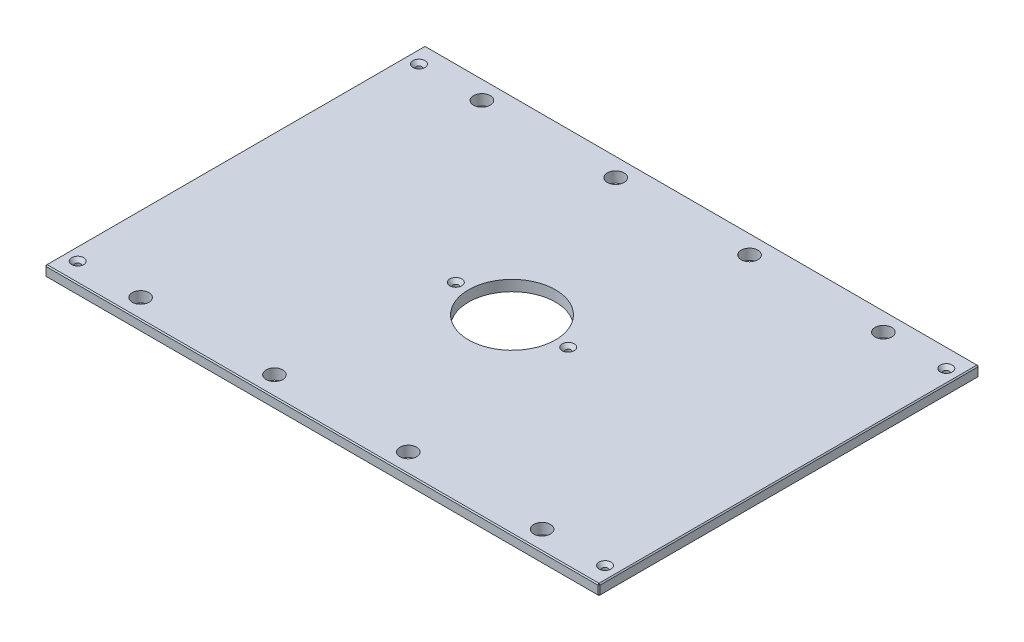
ISO-10303-21;
HEADER;
FILE_DESCRIPTION(('STEP AP214'),'2;1');
FILE_NAME('part.step','',(''),(''),'','','');
FILE_SCHEMA(('AUTOMOTIVE_DESIGN { 1 0 10303 214 1 1 1 1 }'));
ENDSEC;
DATA;
#1=APPLICATION_CONTEXT('core data for automotive mechanical design processes');
#2=APPLICATION_PROTOCOL_DEFINITION('international standard','automotive_design',2000,#1);
#3=PRODUCT_CONTEXT('',#1,'mechanical');
#4=PRODUCT('Part','Part','',(#3));
#5=PRODUCT_RELATED_PRODUCT_CATEGORY('part','',(#4));
#6=PRODUCT_DEFINITION_FORMATION('','',#4);
#7=PRODUCT_DEFINITION_CONTEXT('part definition',#1,'design');
#8=PRODUCT_DEFINITION('design','',#6,#7);
#9=PRODUCT_DEFINITION_SHAPE('','',#8);
#10=(LENGTH_UNIT() NAMED_UNIT(*) SI_UNIT(.MILLI.,.METRE.));
#11=(NAMED_UNIT(*) PLANE_ANGLE_UNIT() SI_UNIT($,.RADIAN.));
#12=(NAMED_UNIT(*) SI_UNIT($,.STERADIAN.) SOLID_ANGLE_UNIT());
#13=UNCERTAINTY_MEASURE_WITH_UNIT(LENGTH_MEASURE(1.E-05),#10,'distance_accuracy_value','');
#14=(GEOMETRIC_REPRESENTATION_CONTEXT(3) GLOBAL_UNCERTAINTY_ASSIGNED_CONTEXT((#13)) GLOBAL_UNIT_ASSIGNED_CONTEXT((#10,
#11,#12)) REPRESENTATION_CONTEXT('',''));
#15=CARTESIAN_POINT('',(0.,0.,0.));
#16=DIRECTION('',(0.,0.,1.));
#17=DIRECTION('',(1.,0.,0.));
#18=AXIS2_PLACEMENT_3D('',#15,#16,#17);
#19=CARTESIAN_POINT('',(-328.6125,12.7,-225.425));
#20=DIRECTION('',(1.,0.,0.));
#21=DIRECTION('',(0.,0.,-1.));
#22=AXIS2_PLACEMENT_3D('',#19,#20,#21);
#23=PLANE('',#22);
#24=DIRECTION('',(0.,0.,-1.));
#25=VECTOR('',#24,1.);
#26=CARTESIAN_POINT('',(-328.6125,11.43,-225.425));
#27=LINE('',#26,#25);
#28=CARTESIAN_POINT('',(-328.6125,11.43,224.155));
#29=VERTEX_POINT('',#28);
#30=CARTESIAN_POINT('',(-328.6125,11.43,-224.155));
#31=VERTEX_POINT('',#30);
#32=EDGE_CURVE('E135',#29,#31,#27,.T.);
#33=ORIENTED_EDGE('',*,*,#32,.T.);
#34=DIRECTION('',(0.,-1.,0.));
#35=VECTOR('',#34,1.);
#36=CARTESIAN_POINT('',(-328.6125,12.7,-224.155));
#37=LINE('',#36,#35);
#38=CARTESIAN_POINT('',(-328.6125,1.26999999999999,-224.155));
#39=VERTEX_POINT('',#38);
#40=EDGE_CURVE('E131',#31,#39,#37,.T.);
#41=ORIENTED_EDGE('',*,*,#40,.T.);
#42=DIRECTION('',(0.,0.,1.));
#43=VECTOR('',#42,1.);
#44=CARTESIAN_POINT('',(-328.6125,1.26999999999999,-225.425));
#45=LINE('',#44,#43);
#46=CARTESIAN_POINT('',(-328.6125,1.26999999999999,224.155));
#47=VERTEX_POINT('',#46);
#48=EDGE_CURVE('E126',#39,#47,#45,.T.);
#49=ORIENTED_EDGE('',*,*,#48,.T.);
#50=DIRECTION('',(0.,1.,0.));
#51=VECTOR('',#50,1.);
#52=CARTESIAN_POINT('',(-328.6125,12.7,224.155));
#53=LINE('',#52,#51);
#54=EDGE_CURVE('E128',#47,#29,#53,.T.);
#55=ORIENTED_EDGE('',*,*,#54,.T.);
#56=EDGE_LOOP('',(#33,#41,#49,#55));
#57=FACE_BOUND('',#56,.T.);
#58=ADVANCED_FACE('F35',(#57),#23,.F.);
#59=CARTESIAN_POINT('',(-328.6125,12.7,225.425));
#60=DIRECTION('',(0.,0.,-1.));
#61=DIRECTION('',(-1.,0.,0.));
#62=AXIS2_PLACEMENT_3D('',#59,#60,#61);
#63=PLANE('',#62);
#64=DIRECTION('',(1.,0.,0.));
#65=VECTOR('',#64,1.);
#66=CARTESIAN_POINT('',(-328.6125,1.2700000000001,225.425));
#67=LINE('',#66,#65);
#68=CARTESIAN_POINT('',(-327.3425,1.2700000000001,225.425));
#69=VERTEX_POINT('',#68);
#70=CARTESIAN_POINT('',(327.3425,1.2700000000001,225.425));
#71=VERTEX_POINT('',#70);
#72=EDGE_CURVE('E58',#69,#71,#67,.T.);
#73=ORIENTED_EDGE('',*,*,#72,.T.);
#74=DIRECTION('',(0.,1.,0.));
#75=VECTOR('',#74,1.);
#76=CARTESIAN_POINT('',(327.3425,12.7,225.425));
#77=LINE('',#76,#75);
#78=CARTESIAN_POINT('',(327.3425,11.4299999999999,225.425));
#79=VERTEX_POINT('',#78);
#80=EDGE_CURVE('E11',#71,#79,#77,.T.);
#81=ORIENTED_EDGE('',*,*,#80,.T.);
#82=DIRECTION('',(-1.,0.,0.));
#83=VECTOR('',#82,1.);
#84=CARTESIAN_POINT('',(-328.6125,11.4299999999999,225.425));
#85=LINE('',#84,#83);
#86=CARTESIAN_POINT('',(-327.3425,11.4299999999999,225.425));
#87=VERTEX_POINT('',#86);
#88=EDGE_CURVE('E44',#79,#87,#85,.T.);
#89=ORIENTED_EDGE('',*,*,#88,.T.);
#90=DIRECTION('',(0.,-1.,0.));
#91=VECTOR('',#90,1.);
#92=CARTESIAN_POINT('',(-327.3425,12.7,225.425));
#93=LINE('',#92,#91);
#94=EDGE_CURVE('E303',#87,#69,#93,.T.);
#95=ORIENTED_EDGE('',*,*,#94,.T.);
#96=EDGE_LOOP('',(#73,#81,#89,#95));
#97=FACE_BOUND('',#96,.T.);
#98=ADVANCED_FACE('F372',(#97),#63,.F.);
#99=CARTESIAN_POINT('',(328.6125,12.7,-225.425));
#100=DIRECTION('',(-1.,0.,0.));
#101=DIRECTION('',(0.,0.,1.));
#102=AXIS2_PLACEMENT_3D('',#99,#100,#101);
#103=PLANE('',#102);
#104=DIRECTION('',(0.,0.,-1.));
#105=VECTOR('',#104,1.);
#106=CARTESIAN_POINT('',(328.6125,1.2700000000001,-225.425));
#107=LINE('',#106,#105);
#108=CARTESIAN_POINT('',(328.6125,1.2700000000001,224.155));
#109=VERTEX_POINT('',#108);
#110=CARTESIAN_POINT('',(328.6125,1.2700000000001,-224.155));
#111=VERTEX_POINT('',#110);
#112=EDGE_CURVE('E298',#109,#111,#107,.T.);
#113=ORIENTED_EDGE('',*,*,#112,.T.);
#114=DIRECTION('',(0.,1.,0.));
#115=VECTOR('',#114,1.);
#116=CARTESIAN_POINT('',(328.6125,12.7,-224.155));
#117=LINE('',#116,#115);
#118=CARTESIAN_POINT('',(328.6125,11.43,-224.155));
#119=VERTEX_POINT('',#118);
#120=EDGE_CURVE('E300',#111,#119,#117,.T.);
#121=ORIENTED_EDGE('',*,*,#120,.T.);
#122=DIRECTION('',(0.,0.,1.));
#123=VECTOR('',#122,1.);
#124=CARTESIAN_POINT('',(328.6125,11.43,225.425));
#125=LINE('',#124,#123);
#126=CARTESIAN_POINT('',(328.6125,11.43,224.155));
#127=VERTEX_POINT('',#126);
#128=EDGE_CURVE('E296',#119,#127,#125,.T.);
#129=ORIENTED_EDGE('',*,*,#128,.T.);
#130=DIRECTION('',(0.,-1.,0.));
#131=VECTOR('',#130,1.);
#132=CARTESIAN_POINT('',(328.6125,12.7,224.155));
#133=LINE('',#132,#131);
#134=EDGE_CURVE('E294',#127,#109,#133,.T.);
#135=ORIENTED_EDGE('',*,*,#134,.T.);
#136=EDGE_LOOP('',(#113,#121,#129,#135));
#137=FACE_BOUND('',#136,.T.);
#138=ADVANCED_FACE('F359',(#137),#103,.F.);
#139=CARTESIAN_POINT('',(-328.6125,12.7,-225.425));
#140=DIRECTION('',(0.,0.,1.));
#141=DIRECTION('',(1.,0.,0.));
#142=AXIS2_PLACEMENT_3D('',#139,#140,#141);
#143=PLANE('',#142);
#144=DIRECTION('',(-1.,0.,0.));
#145=VECTOR('',#144,1.);
#146=CARTESIAN_POINT('',(-328.6125,1.2700000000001,-225.425));
#147=LINE('',#146,#145);
#148=CARTESIAN_POINT('',(327.3425,1.2700000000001,-225.425));
#149=VERTEX_POINT('',#148);
#150=CARTESIAN_POINT('',(-327.3425,1.2700000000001,-225.425));
#151=VERTEX_POINT('',#150);
#152=EDGE_CURVE('E270',#149,#151,#147,.T.);
#153=ORIENTED_EDGE('',*,*,#152,.T.);
#154=DIRECTION('',(0.,1.,0.));
#155=VECTOR('',#154,1.);
#156=CARTESIAN_POINT('',(-327.3425,12.7,-225.425));
#157=LINE('',#156,#155);
#158=CARTESIAN_POINT('',(-327.3425,11.43,-225.425));
#159=VERTEX_POINT('',#158);
#160=EDGE_CURVE('E274',#151,#159,#157,.T.);
#161=ORIENTED_EDGE('',*,*,#160,.T.);
#162=DIRECTION('',(1.,0.,0.));
#163=VECTOR('',#162,1.);
#164=CARTESIAN_POINT('',(328.6125,11.43,-225.425));
#165=LINE('',#164,#163);
#166=CARTESIAN_POINT('',(327.3425,11.43,-225.425));
#167=VERTEX_POINT('',#166);
#168=EDGE_CURVE('E272',#159,#167,#165,.T.);
#169=ORIENTED_EDGE('',*,*,#168,.T.);
#170=DIRECTION('',(0.,-1.,0.));
#171=VECTOR('',#170,1.);
#172=CARTESIAN_POINT('',(327.3425,12.7,-225.425));
#173=LINE('',#172,#171);
#174=EDGE_CURVE('E268',#167,#149,#173,.T.);
#175=ORIENTED_EDGE('',*,*,#174,.T.);
#176=EDGE_LOOP('',(#153,#161,#169,#175));
#177=FACE_BOUND('',#176,.T.);
#178=ADVANCED_FACE('F333',(#177),#143,.F.);
#179=CARTESIAN_POINT('',(0.,12.7,0.));
#180=DIRECTION('',(0.,1.,0.));
#181=DIRECTION('',(0.,0.,1.));
#182=AXIS2_PLACEMENT_3D('',#179,#180,#181);
#183=PLANE('',#182);
#184=CARTESIAN_POINT('',(312.7375,12.7,-202.40498));
#185=DIRECTION('',(0.,1.,0.));
#186=DIRECTION('',(0.,0.,1.));
#187=AXIS2_PLACEMENT_3D('',#184,#185,#186);
#188=CIRCLE('',#187,7.13740000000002);
#189=CARTESIAN_POINT('',(312.7375,12.7,-195.26758));
#190=VERTEX_POINT('',#189);
#191=EDGE_CURVE('E816',#190,#190,#188,.T.);
#192=ORIENTED_EDGE('',*,*,#191,.F.);
#193=EDGE_LOOP('',(#192));
#194=FACE_BOUND('',#193,.T.);
#195=CARTESIAN_POINT('',(312.7375,12.7,202.40498));
#196=DIRECTION('',(0.,1.,0.));
#197=DIRECTION('',(0.,0.,1.));
#198=AXIS2_PLACEMENT_3D('',#195,#196,#197);
#199=CIRCLE('',#198,7.13740000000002);
#200=CARTESIAN_POINT('',(312.7375,12.7,209.54238));
#201=VERTEX_POINT('',#200);
#202=EDGE_CURVE('E820',#201,#201,#199,.T.);
#203=ORIENTED_EDGE('',*,*,#202,.F.);
#204=EDGE_LOOP('',(#203));
#205=FACE_BOUND('',#204,.T.);
#206=CARTESIAN_POINT('',(-312.7375,12.7,202.40498));
#207=DIRECTION('',(0.,1.,0.));
#208=DIRECTION('',(0.,0.,1.));
#209=AXIS2_PLACEMENT_3D('',#206,#207,#208);
#210=CIRCLE('',#209,7.13740000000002);
#211=CARTESIAN_POINT('',(-312.7375,12.7,209.54238));
#212=VERTEX_POINT('',#211);
#213=EDGE_CURVE('E824',#212,#212,#210,.T.);
#214=ORIENTED_EDGE('',*,*,#213,.F.);
#215=EDGE_LOOP('',(#214));
#216=FACE_BOUND('',#215,.T.);
#217=CARTESIAN_POINT('',(-66.675,12.7,0.));
#218=DIRECTION('',(0.,1.,0.));
#219=DIRECTION('',(0.,0.,1.));
#220=AXIS2_PLACEMENT_3D('',#217,#218,#219);
#221=CIRCLE('',#220,7.1374);
#222=CARTESIAN_POINT('',(-66.675,12.7,7.1374));
#223=VERTEX_POINT('',#222);
#224=EDGE_CURVE('E828',#223,#223,#221,.T.);
#225=ORIENTED_EDGE('',*,*,#224,.F.);
#226=EDGE_LOOP('',(#225));
#227=FACE_BOUND('',#226,.T.);
#228=CARTESIAN_POINT('',(66.675,12.7,0.));
#229=DIRECTION('',(0.,1.,0.));
#230=DIRECTION('',(0.,0.,1.));
#231=AXIS2_PLACEMENT_3D('',#228,#229,#230);
#232=CIRCLE('',#231,7.1374);
#233=CARTESIAN_POINT('',(66.675,12.7,7.1374));
#234=VERTEX_POINT('',#233);
#235=EDGE_CURVE('E832',#234,#234,#232,.T.);
#236=ORIENTED_EDGE('',*,*,#235,.F.);
#237=EDGE_LOOP('',(#236));
#238=FACE_BOUND('',#237,.T.);
#239=CARTESIAN_POINT('',(-312.7375,12.7,-202.40498));
#240=DIRECTION('',(0.,1.,0.));
#241=DIRECTION('',(0.,0.,1.));
#242=AXIS2_PLACEMENT_3D('',#239,#240,#241);
#243=CIRCLE('',#242,7.13740000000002);
#244=CARTESIAN_POINT('',(-312.7375,12.7,-195.26758));
#245=VERTEX_POINT('',#244);
#246=EDGE_CURVE('E835',#245,#245,#243,.T.);
#247=ORIENTED_EDGE('',*,*,#246,.F.);
#248=EDGE_LOOP('',(#247));
#249=FACE_BOUND('',#248,.T.);
#250=DIRECTION('',(0.,0.,-1.));
#251=VECTOR('',#250,1.);
#252=CARTESIAN_POINT('',(327.3425,12.7,-225.425));
#253=LINE('',#252,#251);
#254=CARTESIAN_POINT('',(327.3425,12.7,224.155));
#255=VERTEX_POINT('',#254);
#256=CARTESIAN_POINT('',(327.3425,12.7,-224.155));
#257=VERTEX_POINT('',#256);
#258=EDGE_CURVE('E281',#255,#257,#253,.T.);
#259=ORIENTED_EDGE('',*,*,#258,.T.);
#260=DIRECTION('',(-1.,0.,0.));
#261=VECTOR('',#260,1.);
#262=CARTESIAN_POINT('',(-328.6125,12.7,-224.155));
#263=LINE('',#262,#261);
#264=CARTESIAN_POINT('',(-327.3425,12.7,-224.155));
#265=VERTEX_POINT('',#264);
#266=EDGE_CURVE('E283',#257,#265,#263,.T.);
#267=ORIENTED_EDGE('',*,*,#266,.T.);
#268=DIRECTION('',(0.,0.,1.));
#269=VECTOR('',#268,1.);
#270=CARTESIAN_POINT('',(-327.3425,12.7,225.425));
#271=LINE('',#270,#269);
#272=CARTESIAN_POINT('',(-327.3425,12.7,224.155));
#273=VERTEX_POINT('',#272);
#274=EDGE_CURVE('E279',#265,#273,#271,.T.);
#275=ORIENTED_EDGE('',*,*,#274,.T.);
#276=DIRECTION('',(1.,0.,0.));
#277=VECTOR('',#276,1.);
#278=CARTESIAN_POINT('',(328.6125,12.7,224.155));
#279=LINE('',#278,#277);
#280=EDGE_CURVE('E277',#273,#255,#279,.T.);
#281=ORIENTED_EDGE('',*,*,#280,.T.);
#282=EDGE_LOOP('',(#259,#267,#275,#281));
#283=FACE_BOUND('',#282,.T.);
#284=CARTESIAN_POINT('',(238.125,12.7,-202.40498));
#285=DIRECTION('',(0.,1.,0.));
#286=DIRECTION('',(0.,0.,1.));
#287=AXIS2_PLACEMENT_3D('',#284,#285,#286);
#288=CIRCLE('',#287,9.921875);
#289=CARTESIAN_POINT('',(238.125,12.7,-192.483105));
#290=VERTEX_POINT('',#289);
#291=EDGE_CURVE('E204',#290,#290,#288,.T.);
#292=ORIENTED_EDGE('',*,*,#291,.F.);
#293=EDGE_LOOP('',(#292));
#294=FACE_BOUND('',#293,.T.);
#295=CARTESIAN_POINT('',(-238.125,12.7,-202.40498));
#296=DIRECTION('',(0.,1.,0.));
#297=DIRECTION('',(0.,0.,1.));
#298=AXIS2_PLACEMENT_3D('',#295,#296,#297);
#299=CIRCLE('',#298,9.921875);
#300=CARTESIAN_POINT('',(-238.125,12.7,-192.483105));
#301=VERTEX_POINT('',#300);
#302=EDGE_CURVE('E214',#301,#301,#299,.T.);
#303=ORIENTED_EDGE('',*,*,#302,.F.);
#304=EDGE_LOOP('',(#303));
#305=FACE_BOUND('',#304,.T.);
#306=CARTESIAN_POINT('',(238.125,12.7,202.40498));
#307=DIRECTION('',(0.,1.,0.));
#308=DIRECTION('',(0.,0.,1.));
#309=AXIS2_PLACEMENT_3D('',#306,#307,#308);
#310=CIRCLE('',#309,9.921875);
#311=CARTESIAN_POINT('',(238.125,12.7,212.326855));
#312=VERTEX_POINT('',#311);
#313=EDGE_CURVE('E225',#312,#312,#310,.T.);
#314=ORIENTED_EDGE('',*,*,#313,.F.);
#315=EDGE_LOOP('',(#314));
#316=FACE_BOUND('',#315,.T.);
#317=CARTESIAN_POINT('',(-238.125,12.7,202.40498));
#318=DIRECTION('',(0.,1.,0.));
#319=DIRECTION('',(0.,0.,1.));
#320=AXIS2_PLACEMENT_3D('',#317,#318,#319);
#321=CIRCLE('',#320,9.921875);
#322=CARTESIAN_POINT('',(-238.125,12.7,212.326855));
#323=VERTEX_POINT('',#322);
#324=EDGE_CURVE('E231',#323,#323,#321,.T.);
#325=ORIENTED_EDGE('',*,*,#324,.F.);
#326=EDGE_LOOP('',(#325));
#327=FACE_BOUND('',#326,.T.);
#328=CARTESIAN_POINT('',(-79.375,12.7,-202.40498));
#329=DIRECTION('',(0.,1.,0.));
#330=DIRECTION('',(0.,0.,1.));
#331=AXIS2_PLACEMENT_3D('',#328,#329,#330);
#332=CIRCLE('',#331,9.921875);
#333=CARTESIAN_POINT('',(-79.375,12.7,-192.483105));
#334=VERTEX_POINT('',#333);
#335=EDGE_CURVE('E237',#334,#334,#332,.T.);
#336=ORIENTED_EDGE('',*,*,#335,.F.);
#337=EDGE_LOOP('',(#336));
#338=FACE_BOUND('',#337,.T.);
#339=CARTESIAN_POINT('',(79.375,12.7,-202.40498));
#340=DIRECTION('',(0.,1.,0.));
#341=DIRECTION('',(0.,0.,1.));
#342=AXIS2_PLACEMENT_3D('',#339,#340,#341);
#343=CIRCLE('',#342,9.921875);
#344=CARTESIAN_POINT('',(79.375,12.7,-192.483105));
#345=VERTEX_POINT('',#344);
#346=EDGE_CURVE('E243',#345,#345,#343,.T.);
#347=ORIENTED_EDGE('',*,*,#346,.F.);
#348=EDGE_LOOP('',(#347));
#349=FACE_BOUND('',#348,.T.);
#350=CARTESIAN_POINT('',(79.375,12.7,202.40498));
#351=DIRECTION('',(0.,1.,0.));
#352=DIRECTION('',(0.,0.,1.));
#353=AXIS2_PLACEMENT_3D('',#350,#351,#352);
#354=CIRCLE('',#353,9.921875);
#355=CARTESIAN_POINT('',(79.375,12.7,212.326855));
#356=VERTEX_POINT('',#355);
#357=EDGE_CURVE('E249',#356,#356,#354,.T.);
#358=ORIENTED_EDGE('',*,*,#357,.F.);
#359=EDGE_LOOP('',(#358));
#360=FACE_BOUND('',#359,.T.);
#361=CARTESIAN_POINT('',(-79.375,12.7,202.40498));
#362=DIRECTION('',(0.,1.,0.));
#363=DIRECTION('',(0.,0.,1.));
#364=AXIS2_PLACEMENT_3D('',#361,#362,#363);
#365=CIRCLE('',#364,9.921875);
#366=CARTESIAN_POINT('',(-79.375,12.7,212.326855));
#367=VERTEX_POINT('',#366);
#368=EDGE_CURVE('E255',#367,#367,#365,.T.);
#369=ORIENTED_EDGE('',*,*,#368,.F.);
#370=EDGE_LOOP('',(#369));
#371=FACE_BOUND('',#370,.T.);
#372=CARTESIAN_POINT('',(0.,12.7,0.));
#373=DIRECTION('',(0.,1.,0.));
#374=DIRECTION('',(0.,0.,1.));
#375=AXIS2_PLACEMENT_3D('',#372,#373,#374);
#376=CIRCLE('',#375,51.562);
#377=CARTESIAN_POINT('',(0.,12.7,51.562));
#378=VERTEX_POINT('',#377);
#379=EDGE_CURVE('E261',#378,#378,#376,.T.);
#380=ORIENTED_EDGE('',*,*,#379,.F.);
#381=EDGE_LOOP('',(#380));
#382=FACE_BOUND('',#381,.T.);
#383=ADVANCED_FACE('F381',(#194,#205,#216,#227,#238,#249,#283,#294,#305,#316,#327,#338,#349,
#360,#371,#382),#183,.T.);
#384=CARTESIAN_POINT('',(0.,0.,0.));
#385=DIRECTION('',(0.,1.,0.));
#386=DIRECTION('',(0.,0.,1.));
#387=AXIS2_PLACEMENT_3D('',#384,#385,#386);
#388=PLANE('',#387);
#389=CARTESIAN_POINT('',(312.7375,0.,-202.40498));
#390=DIRECTION('',(0.,1.,0.));
#391=DIRECTION('',(0.,0.,1.));
#392=AXIS2_PLACEMENT_3D('',#389,#390,#391);
#393=CIRCLE('',#392,3.3782);
#394=CARTESIAN_POINT('',(312.7375,0.,-199.02678));
#395=VERTEX_POINT('',#394);
#396=EDGE_CURVE('E869',#395,#395,#393,.T.);
#397=ORIENTED_EDGE('',*,*,#396,.T.);
#398=EDGE_LOOP('',(#397));
#399=FACE_BOUND('',#398,.T.);
#400=CARTESIAN_POINT('',(312.7375,0.,202.40498));
#401=DIRECTION('',(0.,1.,0.));
#402=DIRECTION('',(0.,0.,1.));
#403=AXIS2_PLACEMENT_3D('',#400,#401,#402);
#404=CIRCLE('',#403,3.3782);
#405=CARTESIAN_POINT('',(312.7375,0.,205.78318));
#406=VERTEX_POINT('',#405);
#407=EDGE_CURVE('E862',#406,#406,#404,.T.);
#408=ORIENTED_EDGE('',*,*,#407,.T.);
#409=EDGE_LOOP('',(#408));
#410=FACE_BOUND('',#409,.T.);
#411=CARTESIAN_POINT('',(-312.7375,0.,202.40498));
#412=DIRECTION('',(0.,1.,0.));
#413=DIRECTION('',(0.,0.,1.));
#414=AXIS2_PLACEMENT_3D('',#411,#412,#413);
#415=CIRCLE('',#414,3.3782);
#416=CARTESIAN_POINT('',(-312.7375,0.,205.78318));
#417=VERTEX_POINT('',#416);
#418=EDGE_CURVE('E855',#417,#417,#415,.T.);
#419=ORIENTED_EDGE('',*,*,#418,.T.);
#420=EDGE_LOOP('',(#419));
#421=FACE_BOUND('',#420,.T.);
#422=CARTESIAN_POINT('',(-66.675,0.,0.));
#423=DIRECTION('',(0.,1.,0.));
#424=DIRECTION('',(0.,0.,1.));
#425=AXIS2_PLACEMENT_3D('',#422,#423,#424);
#426=CIRCLE('',#425,3.3782);
#427=CARTESIAN_POINT('',(-66.675,0.,3.3782));
#428=VERTEX_POINT('',#427);
#429=EDGE_CURVE('E848',#428,#428,#426,.T.);
#430=ORIENTED_EDGE('',*,*,#429,.T.);
#431=EDGE_LOOP('',(#430));
#432=FACE_BOUND('',#431,.T.);
#433=CARTESIAN_POINT('',(66.675,0.,0.));
#434=DIRECTION('',(0.,1.,0.));
#435=DIRECTION('',(0.,0.,1.));
#436=AXIS2_PLACEMENT_3D('',#433,#434,#435);
#437=CIRCLE('',#436,3.3782);
#438=CARTESIAN_POINT('',(66.675,0.,3.3782));
#439=VERTEX_POINT('',#438);
#440=EDGE_CURVE('E838',#439,#439,#437,.T.);
#441=ORIENTED_EDGE('',*,*,#440,.T.);
#442=EDGE_LOOP('',(#441));
#443=FACE_BOUND('',#442,.T.);
#444=CARTESIAN_POINT('',(-312.7375,0.,-202.40498));
#445=DIRECTION('',(0.,1.,0.));
#446=DIRECTION('',(0.,0.,1.));
#447=AXIS2_PLACEMENT_3D('',#444,#445,#446);
#448=CIRCLE('',#447,3.3782);
#449=CARTESIAN_POINT('',(-312.7375,0.,-199.02678));
#450=VERTEX_POINT('',#449);
#451=EDGE_CURVE('E217',#450,#450,#448,.T.);
#452=ORIENTED_EDGE('',*,*,#451,.T.);
#453=EDGE_LOOP('',(#452));
#454=FACE_BOUND('',#453,.T.);
#455=DIRECTION('',(0.,0.,-1.));
#456=VECTOR('',#455,1.);
#457=CARTESIAN_POINT('',(-327.3425,0.,0.));
#458=LINE('',#457,#456);
#459=CARTESIAN_POINT('',(-327.3425,0.,224.155));
#460=VERTEX_POINT('',#459);
#461=CARTESIAN_POINT('',(-327.3425,0.,-224.155));
#462=VERTEX_POINT('',#461);
#463=EDGE_CURVE('E158',#460,#462,#458,.T.);
#464=ORIENTED_EDGE('',*,*,#463,.T.);
#465=DIRECTION('',(1.,0.,0.));
#466=VECTOR('',#465,1.);
#467=CARTESIAN_POINT('',(0.,0.,-224.155));
#468=LINE('',#467,#466);
#469=CARTESIAN_POINT('',(327.3425,0.,-224.155));
#470=VERTEX_POINT('',#469);
#471=EDGE_CURVE('E291',#462,#470,#468,.T.);
#472=ORIENTED_EDGE('',*,*,#471,.T.);
#473=DIRECTION('',(0.,0.,1.));
#474=VECTOR('',#473,1.);
#475=CARTESIAN_POINT('',(327.3425,0.,0.));
#476=LINE('',#475,#474);
#477=CARTESIAN_POINT('',(327.3425,0.,224.155));
#478=VERTEX_POINT('',#477);
#479=EDGE_CURVE('E289',#470,#478,#476,.T.);
#480=ORIENTED_EDGE('',*,*,#479,.T.);
#481=DIRECTION('',(-1.,0.,0.));
#482=VECTOR('',#481,1.);
#483=CARTESIAN_POINT('',(0.,0.,224.155));
#484=LINE('',#483,#482);
#485=EDGE_CURVE('E286',#478,#460,#484,.T.);
#486=ORIENTED_EDGE('',*,*,#485,.T.);
#487=EDGE_LOOP('',(#464,#472,#480,#486));
#488=FACE_BOUND('',#487,.T.);
#489=CARTESIAN_POINT('',(238.125,0.,-202.40498));
#490=DIRECTION('',(0.,1.,0.));
#491=DIRECTION('',(0.,0.,1.));
#492=AXIS2_PLACEMENT_3D('',#489,#490,#491);
#493=CIRCLE('',#492,9.921875);
#494=CARTESIAN_POINT('',(238.125,0.,-192.483105));
#495=VERTEX_POINT('',#494);
#496=EDGE_CURVE('E209',#495,#495,#493,.T.);
#497=ORIENTED_EDGE('',*,*,#496,.T.);
#498=EDGE_LOOP('',(#497));
#499=FACE_BOUND('',#498,.T.);
#500=CARTESIAN_POINT('',(-238.125,0.,-202.40498));
#501=DIRECTION('',(0.,1.,0.));
#502=DIRECTION('',(0.,0.,1.));
#503=AXIS2_PLACEMENT_3D('',#500,#501,#502);
#504=CIRCLE('',#503,9.921875);
#505=CARTESIAN_POINT('',(-238.125,0.,-192.483105));
#506=VERTEX_POINT('',#505);
#507=EDGE_CURVE('E222',#506,#506,#504,.T.);
#508=ORIENTED_EDGE('',*,*,#507,.T.);
#509=EDGE_LOOP('',(#508));
#510=FACE_BOUND('',#509,.T.);
#511=CARTESIAN_POINT('',(238.125,0.,202.40498));
#512=DIRECTION('',(0.,1.,0.));
#513=DIRECTION('',(0.,0.,1.));
#514=AXIS2_PLACEMENT_3D('',#511,#512,#513);
#515=CIRCLE('',#514,9.921875);
#516=CARTESIAN_POINT('',(238.125,0.,212.326855));
#517=VERTEX_POINT('',#516);
#518=EDGE_CURVE('E228',#517,#517,#515,.T.);
#519=ORIENTED_EDGE('',*,*,#518,.T.);
#520=EDGE_LOOP('',(#519));
#521=FACE_BOUND('',#520,.T.);
#522=CARTESIAN_POINT('',(-238.125,0.,202.40498));
#523=DIRECTION('',(0.,1.,0.));
#524=DIRECTION('',(0.,0.,1.));
#525=AXIS2_PLACEMENT_3D('',#522,#523,#524);
#526=CIRCLE('',#525,9.921875);
#527=CARTESIAN_POINT('',(-238.125,0.,212.326855));
#528=VERTEX_POINT('',#527);
#529=EDGE_CURVE('E234',#528,#528,#526,.T.);
#530=ORIENTED_EDGE('',*,*,#529,.T.);
#531=EDGE_LOOP('',(#530));
#532=FACE_BOUND('',#531,.T.);
#533=CARTESIAN_POINT('',(-79.375,0.,-202.40498));
#534=DIRECTION('',(0.,1.,0.));
#535=DIRECTION('',(0.,0.,1.));
#536=AXIS2_PLACEMENT_3D('',#533,#534,#535);
#537=CIRCLE('',#536,9.921875);
#538=CARTESIAN_POINT('',(-79.375,0.,-192.483105));
#539=VERTEX_POINT('',#538);
#540=EDGE_CURVE('E240',#539,#539,#537,.T.);
#541=ORIENTED_EDGE('',*,*,#540,.T.);
#542=EDGE_LOOP('',(#541));
#543=FACE_BOUND('',#542,.T.);
#544=CARTESIAN_POINT('',(79.375,0.,-202.40498));
#545=DIRECTION('',(0.,1.,0.));
#546=DIRECTION('',(0.,0.,1.));
#547=AXIS2_PLACEMENT_3D('',#544,#545,#546);
#548=CIRCLE('',#547,9.921875);
#549=CARTESIAN_POINT('',(79.375,0.,-192.483105));
#550=VERTEX_POINT('',#549);
#551=EDGE_CURVE('E246',#550,#550,#548,.T.);
#552=ORIENTED_EDGE('',*,*,#551,.T.);
#553=EDGE_LOOP('',(#552));
#554=FACE_BOUND('',#553,.T.);
#555=CARTESIAN_POINT('',(79.375,0.,202.40498));
#556=DIRECTION('',(0.,1.,0.));
#557=DIRECTION('',(0.,0.,1.));
#558=AXIS2_PLACEMENT_3D('',#555,#556,#557);
#559=CIRCLE('',#558,9.921875);
#560=CARTESIAN_POINT('',(79.375,0.,212.326855));
#561=VERTEX_POINT('',#560);
#562=EDGE_CURVE('E252',#561,#561,#559,.T.);
#563=ORIENTED_EDGE('',*,*,#562,.T.);
#564=EDGE_LOOP('',(#563));
#565=FACE_BOUND('',#564,.T.);
#566=CARTESIAN_POINT('',(-79.375,0.,202.40498));
#567=DIRECTION('',(0.,1.,0.));
#568=DIRECTION('',(0.,0.,1.));
#569=AXIS2_PLACEMENT_3D('',#566,#567,#568);
#570=CIRCLE('',#569,9.921875);
#571=CARTESIAN_POINT('',(-79.375,0.,212.326855));
#572=VERTEX_POINT('',#571);
#573=EDGE_CURVE('E258',#572,#572,#570,.T.);
#574=ORIENTED_EDGE('',*,*,#573,.T.);
#575=EDGE_LOOP('',(#574));
#576=FACE_BOUND('',#575,.T.);
#577=CARTESIAN_POINT('',(0.,0.,0.));
#578=DIRECTION('',(0.,1.,0.));
#579=DIRECTION('',(0.,0.,1.));
#580=AXIS2_PLACEMENT_3D('',#577,#578,#579);
#581=CIRCLE('',#580,51.562);
#582=CARTESIAN_POINT('',(0.,0.,51.562));
#583=VERTEX_POINT('',#582);
#584=EDGE_CURVE('E147',#583,#583,#581,.T.);
#585=ORIENTED_EDGE('',*,*,#584,.T.);
#586=EDGE_LOOP('',(#585));
#587=FACE_BOUND('',#586,.T.);
#588=ADVANCED_FACE('F346',(#399,#410,#421,#432,#443,#454,#488,#499,#510,#521,#532,#543,#554,
#565,#576,#587),#388,.F.);
#589=CARTESIAN_POINT('',(0.,0.,0.));
#590=DIRECTION('',(0.,1.,0.));
#591=DIRECTION('',(0.,0.,1.));
#592=AXIS2_PLACEMENT_3D('',#589,#590,#591);
#593=CYLINDRICAL_SURFACE('',#592,51.562);
#594=ORIENTED_EDGE('',*,*,#584,.F.);
#595=EDGE_LOOP('',(#594));
#596=FACE_BOUND('',#595,.T.);
#597=ORIENTED_EDGE('',*,*,#379,.T.);
#598=EDGE_LOOP('',(#597));
#599=FACE_BOUND('',#598,.T.);
#600=ADVANCED_FACE('F751',(#596,#599),#593,.F.);
#601=CARTESIAN_POINT('',(-79.375,12.7,202.40498));
#602=DIRECTION('',(0.,1.,0.));
#603=DIRECTION('',(0.,0.,1.));
#604=AXIS2_PLACEMENT_3D('',#601,#602,#603);
#605=CYLINDRICAL_SURFACE('',#604,9.921875);
#606=ORIENTED_EDGE('',*,*,#573,.F.);
#607=EDGE_LOOP('',(#606));
#608=FACE_BOUND('',#607,.T.);
#609=ORIENTED_EDGE('',*,*,#368,.T.);
#610=EDGE_LOOP('',(#609));
#611=FACE_BOUND('',#610,.T.);
#612=ADVANCED_FACE('F742',(#608,#611),#605,.F.);
#613=CARTESIAN_POINT('',(79.375,12.7,202.40498));
#614=DIRECTION('',(0.,1.,0.));
#615=DIRECTION('',(0.,0.,1.));
#616=AXIS2_PLACEMENT_3D('',#613,#614,#615);
#617=CYLINDRICAL_SURFACE('',#616,9.921875);
#618=ORIENTED_EDGE('',*,*,#562,.F.);
#619=EDGE_LOOP('',(#618));
#620=FACE_BOUND('',#619,.T.);
#621=ORIENTED_EDGE('',*,*,#357,.T.);
#622=EDGE_LOOP('',(#621));
#623=FACE_BOUND('',#622,.T.);
#624=ADVANCED_FACE('F733',(#620,#623),#617,.F.);
#625=CARTESIAN_POINT('',(79.375,12.7,-202.40498));
#626=DIRECTION('',(0.,1.,0.));
#627=DIRECTION('',(0.,0.,1.));
#628=AXIS2_PLACEMENT_3D('',#625,#626,#627);
#629=CYLINDRICAL_SURFACE('',#628,9.921875);
#630=ORIENTED_EDGE('',*,*,#551,.F.);
#631=EDGE_LOOP('',(#630));
#632=FACE_BOUND('',#631,.T.);
#633=ORIENTED_EDGE('',*,*,#346,.T.);
#634=EDGE_LOOP('',(#633));
#635=FACE_BOUND('',#634,.T.);
#636=ADVANCED_FACE('F724',(#632,#635),#629,.F.);
#637=CARTESIAN_POINT('',(-79.375,12.7,-202.40498));
#638=DIRECTION('',(0.,1.,0.));
#639=DIRECTION('',(0.,0.,1.));
#640=AXIS2_PLACEMENT_3D('',#637,#638,#639);
#641=CYLINDRICAL_SURFACE('',#640,9.921875);
#642=ORIENTED_EDGE('',*,*,#540,.F.);
#643=EDGE_LOOP('',(#642));
#644=FACE_BOUND('',#643,.T.);
#645=ORIENTED_EDGE('',*,*,#335,.T.);
#646=EDGE_LOOP('',(#645));
#647=FACE_BOUND('',#646,.T.);
#648=ADVANCED_FACE('F715',(#644,#647),#641,.F.);
#649=CARTESIAN_POINT('',(-238.125,12.7,202.40498));
#650=DIRECTION('',(0.,1.,0.));
#651=DIRECTION('',(0.,0.,1.));
#652=AXIS2_PLACEMENT_3D('',#649,#650,#651);
#653=CYLINDRICAL_SURFACE('',#652,9.921875);
#654=ORIENTED_EDGE('',*,*,#529,.F.);
#655=EDGE_LOOP('',(#654));
#656=FACE_BOUND('',#655,.T.);
#657=ORIENTED_EDGE('',*,*,#324,.T.);
#658=EDGE_LOOP('',(#657));
#659=FACE_BOUND('',#658,.T.);
#660=ADVANCED_FACE('F706',(#656,#659),#653,.F.);
#661=CARTESIAN_POINT('',(238.125,12.7,202.40498));
#662=DIRECTION('',(0.,1.,0.));
#663=DIRECTION('',(0.,0.,1.));
#664=AXIS2_PLACEMENT_3D('',#661,#662,#663);
#665=CYLINDRICAL_SURFACE('',#664,9.921875);
#666=ORIENTED_EDGE('',*,*,#518,.F.);
#667=EDGE_LOOP('',(#666));
#668=FACE_BOUND('',#667,.T.);
#669=ORIENTED_EDGE('',*,*,#313,.T.);
#670=EDGE_LOOP('',(#669));
#671=FACE_BOUND('',#670,.T.);
#672=ADVANCED_FACE('F697',(#668,#671),#665,.F.);
#673=CARTESIAN_POINT('',(-238.125,12.7,-202.40498));
#674=DIRECTION('',(0.,1.,0.));
#675=DIRECTION('',(0.,0.,1.));
#676=AXIS2_PLACEMENT_3D('',#673,#674,#675);
#677=CYLINDRICAL_SURFACE('',#676,9.921875);
#678=ORIENTED_EDGE('',*,*,#507,.F.);
#679=EDGE_LOOP('',(#678));
#680=FACE_BOUND('',#679,.T.);
#681=ORIENTED_EDGE('',*,*,#302,.T.);
#682=EDGE_LOOP('',(#681));
#683=FACE_BOUND('',#682,.T.);
#684=ADVANCED_FACE('F687',(#680,#683),#677,.F.);
#685=CARTESIAN_POINT('',(238.125,12.7,-202.40498));
#686=DIRECTION('',(0.,1.,0.));
#687=DIRECTION('',(0.,0.,1.));
#688=AXIS2_PLACEMENT_3D('',#685,#686,#687);
#689=CYLINDRICAL_SURFACE('',#688,9.921875);
#690=ORIENTED_EDGE('',*,*,#496,.F.);
#691=EDGE_LOOP('',(#690));
#692=FACE_BOUND('',#691,.T.);
#693=ORIENTED_EDGE('',*,*,#291,.T.);
#694=EDGE_LOOP('',(#693));
#695=FACE_BOUND('',#694,.T.);
#696=ADVANCED_FACE('F390',(#692,#695),#689,.F.);
#697=CARTESIAN_POINT('',(328.6125,12.7,224.155));
#698=DIRECTION('',(-0.707106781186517,0.,-0.707106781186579));
#699=DIRECTION('',(0.,-1.,0.));
#700=AXIS2_PLACEMENT_3D('',#697,#698,#699);
#701=PLANE('',#700);
#702=DIRECTION('',(-0.707106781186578,0.,0.707106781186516));
#703=VECTOR('',#702,1.);
#704=CARTESIAN_POINT('',(328.6125,11.43,224.155));
#705=LINE('',#704,#703);
#706=EDGE_CURVE('E39',#79,#127,#705,.F.);
#707=ORIENTED_EDGE('',*,*,#706,.F.);
#708=ORIENTED_EDGE('',*,*,#80,.F.);
#709=DIRECTION('',(0.707106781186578,0.,-0.707106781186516));
#710=VECTOR('',#709,1.);
#711=CARTESIAN_POINT('',(327.9775,1.2700000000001,224.79));
#712=LINE('',#711,#710);
#713=EDGE_CURVE('E197',#109,#71,#712,.F.);
#714=ORIENTED_EDGE('',*,*,#713,.F.);
#715=ORIENTED_EDGE('',*,*,#134,.F.);
#716=EDGE_LOOP('',(#707,#708,#714,#715));
#717=FACE_BOUND('',#716,.T.);
#718=ADVANCED_FACE('F37',(#717),#701,.F.);
#719=CARTESIAN_POINT('',(328.6125,11.43,224.155));
#720=DIRECTION('',(0.577350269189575,0.577350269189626,0.577350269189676));
#721=DIRECTION('',(0.,-0.707106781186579,0.707106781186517));
#722=AXIS2_PLACEMENT_3D('',#719,#720,#721);
#723=PLANE('',#722);
#724=DIRECTION('',(0.,-0.707106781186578,0.707106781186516));
#725=VECTOR('',#724,1.);
#726=CARTESIAN_POINT('',(327.3425,12.0649999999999,224.79));
#727=LINE('',#726,#725);
#728=EDGE_CURVE('E193',#79,#255,#727,.F.);
#729=ORIENTED_EDGE('',*,*,#728,.F.);
#730=ORIENTED_EDGE('',*,*,#706,.T.);
#731=DIRECTION('',(-0.707106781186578,0.707106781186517,0.));
#732=VECTOR('',#731,1.);
#733=CARTESIAN_POINT('',(328.6125,11.43,224.155));
#734=LINE('',#733,#732);
#735=EDGE_CURVE('E195',#255,#127,#734,.F.);
#736=ORIENTED_EDGE('',*,*,#735,.F.);
#737=EDGE_LOOP('',(#729,#730,#736));
#738=FACE_BOUND('',#737,.T.);
#739=ADVANCED_FACE('F383',(#738),#723,.T.);
#740=CARTESIAN_POINT('',(327.3425,0.,224.155));
#741=DIRECTION('',(0.577350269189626,-0.577350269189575,0.577350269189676));
#742=DIRECTION('',(0.707106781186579,0.,-0.707106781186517));
#743=AXIS2_PLACEMENT_3D('',#740,#741,#742);
#744=PLANE('',#743);
#745=DIRECTION('',(-0.707106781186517,-0.707106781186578,0.));
#746=VECTOR('',#745,1.);
#747=CARTESIAN_POINT('',(327.3425,0.,224.155));
#748=LINE('',#747,#746);
#749=EDGE_CURVE('E187',#109,#478,#748,.T.);
#750=ORIENTED_EDGE('',*,*,#749,.F.);
#751=ORIENTED_EDGE('',*,*,#713,.T.);
#752=DIRECTION('',(0.,0.707106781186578,0.707106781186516));
#753=VECTOR('',#752,1.);
#754=CARTESIAN_POINT('',(327.3425,0.,224.155));
#755=LINE('',#754,#753);
#756=EDGE_CURVE('E190',#478,#71,#755,.T.);
#757=ORIENTED_EDGE('',*,*,#756,.F.);
#758=EDGE_LOOP('',(#750,#751,#757));
#759=FACE_BOUND('',#758,.T.);
#760=ADVANCED_FACE('F352',(#759),#744,.T.);
#761=CARTESIAN_POINT('',(327.3425,12.7,0.));
#762=DIRECTION('',(0.707106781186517,0.707106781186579,0.));
#763=DIRECTION('',(0.,0.,1.));
#764=AXIS2_PLACEMENT_3D('',#761,#762,#763);
#765=PLANE('',#764);
#766=ORIENTED_EDGE('',*,*,#735,.T.);
#767=ORIENTED_EDGE('',*,*,#128,.F.);
#768=DIRECTION('',(0.707106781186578,-0.707106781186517,0.));
#769=VECTOR('',#768,1.);
#770=CARTESIAN_POINT('',(327.9775,12.065,-224.155));
#771=LINE('',#770,#769);
#772=EDGE_CURVE('E182',#257,#119,#771,.T.);
#773=ORIENTED_EDGE('',*,*,#772,.F.);
#774=ORIENTED_EDGE('',*,*,#258,.F.);
#775=EDGE_LOOP('',(#766,#767,#773,#774));
#776=FACE_BOUND('',#775,.T.);
#777=ADVANCED_FACE('F369',(#776),#765,.T.);
#778=CARTESIAN_POINT('',(0.,12.7,224.155));
#779=DIRECTION('',(0.,0.707106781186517,0.707106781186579));
#780=DIRECTION('',(-1.,0.,0.));
#781=AXIS2_PLACEMENT_3D('',#778,#779,#780);
#782=PLANE('',#781);
#783=ORIENTED_EDGE('',*,*,#728,.T.);
#784=ORIENTED_EDGE('',*,*,#280,.F.);
#785=DIRECTION('',(0.,0.707106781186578,-0.707106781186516));
#786=VECTOR('',#785,1.);
#787=CARTESIAN_POINT('',(-327.3425,12.7,224.155));
#788=LINE('',#787,#786);
#789=EDGE_CURVE('E179',#87,#273,#788,.T.);
#790=ORIENTED_EDGE('',*,*,#789,.F.);
#791=ORIENTED_EDGE('',*,*,#88,.F.);
#792=EDGE_LOOP('',(#783,#784,#790,#791));
#793=FACE_BOUND('',#792,.T.);
#794=ADVANCED_FACE('F374',(#793),#782,.T.);
#795=CARTESIAN_POINT('',(-327.3425,12.7,225.425));
#796=DIRECTION('',(0.707106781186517,0.,-0.707106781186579));
#797=DIRECTION('',(0.,-1.,0.));
#798=AXIS2_PLACEMENT_3D('',#795,#796,#797);
#799=PLANE('',#798);
#800=DIRECTION('',(0.707106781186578,0.,0.707106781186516));
#801=VECTOR('',#800,1.);
#802=CARTESIAN_POINT('',(-328.6125,1.26999999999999,224.155));
#803=LINE('',#802,#801);
#804=EDGE_CURVE('E142',#69,#47,#803,.F.);
#805=ORIENTED_EDGE('',*,*,#804,.F.);
#806=ORIENTED_EDGE('',*,*,#94,.F.);
#807=DIRECTION('',(-0.707106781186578,0.,-0.707106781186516));
#808=VECTOR('',#807,1.);
#809=CARTESIAN_POINT('',(-327.9775,11.4299999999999,224.79));
#810=LINE('',#809,#808);
#811=EDGE_CURVE('E145',#29,#87,#810,.F.);
#812=ORIENTED_EDGE('',*,*,#811,.F.);
#813=ORIENTED_EDGE('',*,*,#54,.F.);
#814=EDGE_LOOP('',(#805,#806,#812,#813));
#815=FACE_BOUND('',#814,.T.);
#816=ADVANCED_FACE('F140',(#815),#799,.F.);
#817=CARTESIAN_POINT('',(-328.6125,1.2700000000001,225.425));
#818=DIRECTION('',(0.,0.707106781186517,-0.707106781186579));
#819=DIRECTION('',(1.,0.,0.));
#820=AXIS2_PLACEMENT_3D('',#817,#818,#819);
#821=PLANE('',#820);
#822=ORIENTED_EDGE('',*,*,#756,.T.);
#823=ORIENTED_EDGE('',*,*,#72,.F.);
#824=DIRECTION('',(0.,-0.707106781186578,-0.707106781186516));
#825=VECTOR('',#824,1.);
#826=CARTESIAN_POINT('',(-327.3425,0.635000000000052,224.79));
#827=LINE('',#826,#825);
#828=EDGE_CURVE('E155',#460,#69,#827,.F.);
#829=ORIENTED_EDGE('',*,*,#828,.F.);
#830=ORIENTED_EDGE('',*,*,#485,.F.);
#831=EDGE_LOOP('',(#822,#823,#829,#830));
#832=FACE_BOUND('',#831,.T.);
#833=ADVANCED_FACE('F351',(#832),#821,.F.);
#834=CARTESIAN_POINT('',(328.6125,1.2700000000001,-225.425));
#835=DIRECTION('',(-0.707106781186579,0.707106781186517,0.));
#836=DIRECTION('',(0.,0.,-1.));
#837=AXIS2_PLACEMENT_3D('',#834,#835,#836);
#838=PLANE('',#837);
#839=ORIENTED_EDGE('',*,*,#749,.T.);
#840=ORIENTED_EDGE('',*,*,#479,.F.);
#841=DIRECTION('',(0.707106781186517,0.707106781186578,0.));
#842=VECTOR('',#841,1.);
#843=CARTESIAN_POINT('',(327.3425,0.,-224.155));
#844=LINE('',#843,#842);
#845=EDGE_CURVE('E174',#111,#470,#844,.F.);
#846=ORIENTED_EDGE('',*,*,#845,.F.);
#847=ORIENTED_EDGE('',*,*,#112,.F.);
#848=EDGE_LOOP('',(#839,#840,#846,#847));
#849=FACE_BOUND('',#848,.T.);
#850=ADVANCED_FACE('F356',(#849),#838,.F.);
#851=CARTESIAN_POINT('',(327.3425,12.7,-225.425));
#852=DIRECTION('',(-0.707106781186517,0.,0.707106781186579));
#853=DIRECTION('',(0.,-1.,0.));
#854=AXIS2_PLACEMENT_3D('',#851,#852,#853);
#855=PLANE('',#854);
#856=DIRECTION('',(0.707106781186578,0.,0.707106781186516));
#857=VECTOR('',#856,1.);
#858=CARTESIAN_POINT('',(327.3425,11.43,-225.425));
#859=LINE('',#858,#857);
#860=EDGE_CURVE('E184',#119,#167,#859,.F.);
#861=ORIENTED_EDGE('',*,*,#860,.F.);
#862=ORIENTED_EDGE('',*,*,#120,.F.);
#863=DIRECTION('',(-0.707106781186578,0.,-0.707106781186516));
#864=VECTOR('',#863,1.);
#865=CARTESIAN_POINT('',(327.9775,1.2700000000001,-224.79));
#866=LINE('',#865,#864);
#867=EDGE_CURVE('E171',#149,#111,#866,.F.);
#868=ORIENTED_EDGE('',*,*,#867,.F.);
#869=ORIENTED_EDGE('',*,*,#174,.F.);
#870=EDGE_LOOP('',(#861,#862,#868,#869));
#871=FACE_BOUND('',#870,.T.);
#872=ADVANCED_FACE('F364',(#871),#855,.F.);
#873=CARTESIAN_POINT('',(327.3425,11.43,-225.425));
#874=DIRECTION('',(0.577350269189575,0.577350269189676,-0.577350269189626));
#875=DIRECTION('',(0.,0.707106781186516,0.707106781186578));
#876=AXIS2_PLACEMENT_3D('',#873,#874,#875);
#877=PLANE('',#876);
#878=ORIENTED_EDGE('',*,*,#772,.T.);
#879=ORIENTED_EDGE('',*,*,#860,.T.);
#880=DIRECTION('',(0.,0.707106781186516,0.707106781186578));
#881=VECTOR('',#880,1.);
#882=CARTESIAN_POINT('',(327.3425,11.43,-225.425));
#883=LINE('',#882,#881);
#884=EDGE_CURVE('E163',#257,#167,#883,.F.);
#885=ORIENTED_EDGE('',*,*,#884,.F.);
#886=EDGE_LOOP('',(#878,#879,#885));
#887=FACE_BOUND('',#886,.T.);
#888=ADVANCED_FACE('F422',(#887),#877,.T.);
#889=CARTESIAN_POINT('',(-327.3425,12.7,224.155));
#890=DIRECTION('',(-0.577350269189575,0.577350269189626,0.577350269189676));
#891=DIRECTION('',(0.,-0.707106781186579,0.707106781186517));
#892=AXIS2_PLACEMENT_3D('',#889,#890,#891);
#893=PLANE('',#892);
#894=ORIENTED_EDGE('',*,*,#811,.T.);
#895=ORIENTED_EDGE('',*,*,#789,.T.);
#896=DIRECTION('',(-0.707106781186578,-0.707106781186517,0.));
#897=VECTOR('',#896,1.);
#898=CARTESIAN_POINT('',(-327.3425,12.7,224.155));
#899=LINE('',#898,#897);
#900=EDGE_CURVE('E159',#29,#273,#899,.F.);
#901=ORIENTED_EDGE('',*,*,#900,.F.);
#902=EDGE_LOOP('',(#894,#895,#901));
#903=FACE_BOUND('',#902,.T.);
#904=ADVANCED_FACE('F376',(#903),#893,.T.);
#905=CARTESIAN_POINT('',(-328.6125,1.26999999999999,224.155));
#906=DIRECTION('',(-0.577350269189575,-0.577350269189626,0.577350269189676));
#907=DIRECTION('',(0.,-0.707106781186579,-0.707106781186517));
#908=AXIS2_PLACEMENT_3D('',#905,#906,#907);
#909=PLANE('',#908);
#910=ORIENTED_EDGE('',*,*,#828,.T.);
#911=ORIENTED_EDGE('',*,*,#804,.T.);
#912=DIRECTION('',(-0.707106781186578,0.707106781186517,0.));
#913=VECTOR('',#912,1.);
#914=CARTESIAN_POINT('',(-328.6125,1.26999999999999,224.155));
#915=LINE('',#914,#913);
#916=EDGE_CURVE('E152',#460,#47,#915,.T.);
#917=ORIENTED_EDGE('',*,*,#916,.F.);
#918=EDGE_LOOP('',(#910,#911,#917));
#919=FACE_BOUND('',#918,.T.);
#920=ADVANCED_FACE('F151',(#919),#909,.T.);
#921=CARTESIAN_POINT('',(327.3425,0.,-224.155));
#922=DIRECTION('',(0.577350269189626,-0.577350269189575,-0.577350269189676));
#923=DIRECTION('',(-0.707106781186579,0.,-0.707106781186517));
#924=AXIS2_PLACEMENT_3D('',#921,#922,#923);
#925=PLANE('',#924);
#926=ORIENTED_EDGE('',*,*,#867,.T.);
#927=ORIENTED_EDGE('',*,*,#845,.T.);
#928=DIRECTION('',(0.,-0.707106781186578,0.707106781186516));
#929=VECTOR('',#928,1.);
#930=CARTESIAN_POINT('',(327.3425,0.,-224.155));
#931=LINE('',#930,#929);
#932=EDGE_CURVE('E160',#149,#470,#931,.T.);
#933=ORIENTED_EDGE('',*,*,#932,.F.);
#934=EDGE_LOOP('',(#926,#927,#933));
#935=FACE_BOUND('',#934,.T.);
#936=ADVANCED_FACE('F414',(#935),#925,.T.);
#937=CARTESIAN_POINT('',(0.,12.7,-224.155));
#938=DIRECTION('',(0.,0.707106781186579,-0.707106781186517));
#939=DIRECTION('',(1.,0.,0.));
#940=AXIS2_PLACEMENT_3D('',#937,#938,#939);
#941=PLANE('',#940);
#942=ORIENTED_EDGE('',*,*,#884,.T.);
#943=ORIENTED_EDGE('',*,*,#168,.F.);
#944=DIRECTION('',(0.,-0.707106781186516,-0.707106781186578));
#945=VECTOR('',#944,1.);
#946=CARTESIAN_POINT('',(-327.3425,11.43,-225.425));
#947=LINE('',#946,#945);
#948=EDGE_CURVE('E165',#265,#159,#947,.T.);
#949=ORIENTED_EDGE('',*,*,#948,.F.);
#950=ORIENTED_EDGE('',*,*,#266,.F.);
#951=EDGE_LOOP('',(#942,#943,#949,#950));
#952=FACE_BOUND('',#951,.T.);
#953=ADVANCED_FACE('F328',(#952),#941,.T.);
#954=CARTESIAN_POINT('',(-327.3425,12.7,0.));
#955=DIRECTION('',(-0.707106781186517,0.707106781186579,0.));
#956=DIRECTION('',(0.,0.,-1.));
#957=AXIS2_PLACEMENT_3D('',#954,#955,#956);
#958=PLANE('',#957);
#959=ORIENTED_EDGE('',*,*,#900,.T.);
#960=ORIENTED_EDGE('',*,*,#274,.F.);
#961=DIRECTION('',(0.707106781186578,0.707106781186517,0.));
#962=VECTOR('',#961,1.);
#963=CARTESIAN_POINT('',(-327.9775,12.065,-224.155));
#964=LINE('',#963,#962);
#965=EDGE_CURVE('E317',#31,#265,#964,.T.);
#966=ORIENTED_EDGE('',*,*,#965,.F.);
#967=ORIENTED_EDGE('',*,*,#32,.F.);
#968=EDGE_LOOP('',(#959,#960,#966,#967));
#969=FACE_BOUND('',#968,.T.);
#970=ADVANCED_FACE('F379',(#969),#958,.T.);
#971=CARTESIAN_POINT('',(-328.6125,1.26999999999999,-225.425));
#972=DIRECTION('',(0.707106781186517,0.707106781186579,0.));
#973=DIRECTION('',(0.,0.,1.));
#974=AXIS2_PLACEMENT_3D('',#971,#972,#973);
#975=PLANE('',#974);
#976=ORIENTED_EDGE('',*,*,#916,.T.);
#977=ORIENTED_EDGE('',*,*,#48,.F.);
#978=DIRECTION('',(0.707106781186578,-0.707106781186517,0.));
#979=VECTOR('',#978,1.);
#980=CARTESIAN_POINT('',(-328.6125,1.26999999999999,-224.155));
#981=LINE('',#980,#979);
#982=EDGE_CURVE('E314',#462,#39,#981,.F.);
#983=ORIENTED_EDGE('',*,*,#982,.F.);
#984=ORIENTED_EDGE('',*,*,#463,.F.);
#985=EDGE_LOOP('',(#976,#977,#983,#984));
#986=FACE_BOUND('',#985,.T.);
#987=ADVANCED_FACE('F157',(#986),#975,.F.);
#988=CARTESIAN_POINT('',(-328.6125,1.2700000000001,-225.425));
#989=DIRECTION('',(0.,0.707106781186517,0.707106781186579));
#990=DIRECTION('',(-1.,0.,0.));
#991=AXIS2_PLACEMENT_3D('',#988,#989,#990);
#992=PLANE('',#991);
#993=ORIENTED_EDGE('',*,*,#932,.T.);
#994=ORIENTED_EDGE('',*,*,#471,.F.);
#995=DIRECTION('',(0.,0.707106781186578,-0.707106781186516));
#996=VECTOR('',#995,1.);
#997=CARTESIAN_POINT('',(-327.3425,0.635000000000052,-224.79));
#998=LINE('',#997,#996);
#999=EDGE_CURVE('E311',#151,#462,#998,.F.);
#1000=ORIENTED_EDGE('',*,*,#999,.F.);
#1001=ORIENTED_EDGE('',*,*,#152,.F.);
#1002=EDGE_LOOP('',(#993,#994,#1000,#1001));
#1003=FACE_BOUND('',#1002,.T.);
#1004=ADVANCED_FACE('F343',(#1003),#992,.F.);
#1005=CARTESIAN_POINT('',(-327.3425,11.43,-225.425));
#1006=DIRECTION('',(-0.577350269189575,0.577350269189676,-0.577350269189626));
#1007=DIRECTION('',(0.,0.707106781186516,0.707106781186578));
#1008=AXIS2_PLACEMENT_3D('',#1005,#1006,#1007);
#1009=PLANE('',#1008);
#1010=ORIENTED_EDGE('',*,*,#965,.T.);
#1011=ORIENTED_EDGE('',*,*,#948,.T.);
#1012=DIRECTION('',(0.707106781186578,0.,-0.707106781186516));
#1013=VECTOR('',#1012,1.);
#1014=CARTESIAN_POINT('',(-327.3425,11.43,-225.425));
#1015=LINE('',#1014,#1013);
#1016=EDGE_CURVE('E309',#31,#159,#1015,.T.);
#1017=ORIENTED_EDGE('',*,*,#1016,.F.);
#1018=EDGE_LOOP('',(#1010,#1011,#1017));
#1019=FACE_BOUND('',#1018,.T.);
#1020=ADVANCED_FACE('F323',(#1019),#1009,.T.);
#1021=CARTESIAN_POINT('',(-328.6125,1.26999999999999,-224.155));
#1022=DIRECTION('',(-0.577350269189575,-0.577350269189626,-0.577350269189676));
#1023=DIRECTION('',(0.,0.707106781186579,-0.707106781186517));
#1024=AXIS2_PLACEMENT_3D('',#1021,#1022,#1023);
#1025=PLANE('',#1024);
#1026=ORIENTED_EDGE('',*,*,#999,.T.);
#1027=ORIENTED_EDGE('',*,*,#982,.T.);
#1028=DIRECTION('',(-0.707106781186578,0.,0.707106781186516));
#1029=VECTOR('',#1028,1.);
#1030=CARTESIAN_POINT('',(-328.6125,1.26999999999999,-224.155));
#1031=LINE('',#1030,#1029);
#1032=EDGE_CURVE('E307',#151,#39,#1031,.T.);
#1033=ORIENTED_EDGE('',*,*,#1032,.F.);
#1034=EDGE_LOOP('',(#1026,#1027,#1033));
#1035=FACE_BOUND('',#1034,.T.);
#1036=ADVANCED_FACE('F340',(#1035),#1025,.T.);
#1037=CARTESIAN_POINT('',(-328.6125,12.7,-224.155));
#1038=DIRECTION('',(0.707106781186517,0.,0.707106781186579));
#1039=DIRECTION('',(0.,-1.,0.));
#1040=AXIS2_PLACEMENT_3D('',#1037,#1038,#1039);
#1041=PLANE('',#1040);
#1042=ORIENTED_EDGE('',*,*,#1016,.T.);
#1043=ORIENTED_EDGE('',*,*,#160,.F.);
#1044=ORIENTED_EDGE('',*,*,#1032,.T.);
#1045=ORIENTED_EDGE('',*,*,#40,.F.);
#1046=EDGE_LOOP('',(#1042,#1043,#1044,#1045));
#1047=FACE_BOUND('',#1046,.T.);
#1048=ADVANCED_FACE('F338',(#1047),#1041,.F.);
#1049=CARTESIAN_POINT('',(-312.7375,12.7,-202.40498));
#1050=DIRECTION('',(0.,1.,0.));
#1051=DIRECTION('',(0.,0.,1.));
#1052=AXIS2_PLACEMENT_3D('',#1049,#1050,#1051);
#1053=CYLINDRICAL_SURFACE('',#1052,3.3782);
#1054=ORIENTED_EDGE('',*,*,#451,.F.);
#1055=EDGE_LOOP('',(#1054));
#1056=FACE_BOUND('',#1055,.T.);
#1057=CARTESIAN_POINT('',(-312.7375,8.37553508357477,-202.40498));
#1058=DIRECTION('',(0.,1.,0.));
#1059=DIRECTION('',(0.,0.,1.));
#1060=AXIS2_PLACEMENT_3D('',#1057,#1058,#1059);
#1061=CIRCLE('',#1060,3.3782);
#1062=CARTESIAN_POINT('',(-312.7375,8.37553508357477,-199.02678));
#1063=VERTEX_POINT('',#1062);
#1064=EDGE_CURVE('E837',#1063,#1063,#1061,.T.);
#1065=ORIENTED_EDGE('',*,*,#1064,.T.);
#1066=EDGE_LOOP('',(#1065));
#1067=FACE_BOUND('',#1066,.T.);
#1068=ADVANCED_FACE('F401',(#1056,#1067),#1053,.F.);
#1069=CARTESIAN_POINT('',(-312.7375,12.7,-202.40498));
#1070=DIRECTION('',(0.,1.,0.));
#1071=DIRECTION('',(0.,0.,1.));
#1072=AXIS2_PLACEMENT_3D('',#1069,#1070,#1071);
#1073=CONICAL_SURFACE('',#1072,7.13740000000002,0.715584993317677);
#1074=ORIENTED_EDGE('',*,*,#1064,.F.);
#1075=EDGE_LOOP('',(#1074));
#1076=FACE_BOUND('',#1075,.T.);
#1077=ORIENTED_EDGE('',*,*,#246,.T.);
#1078=EDGE_LOOP('',(#1077));
#1079=FACE_BOUND('',#1078,.T.);
#1080=ADVANCED_FACE('F511',(#1076,#1079),#1073,.F.);
#1081=CARTESIAN_POINT('',(66.675,12.7,0.));
#1082=DIRECTION('',(0.,1.,0.));
#1083=DIRECTION('',(0.,0.,1.));
#1084=AXIS2_PLACEMENT_3D('',#1081,#1082,#1083);
#1085=CYLINDRICAL_SURFACE('',#1084,3.3782);
#1086=ORIENTED_EDGE('',*,*,#440,.F.);
#1087=EDGE_LOOP('',(#1086));
#1088=FACE_BOUND('',#1087,.T.);
#1089=CARTESIAN_POINT('',(66.675,8.37553508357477,0.));
#1090=DIRECTION('',(0.,1.,0.));
#1091=DIRECTION('',(0.,0.,1.));
#1092=AXIS2_PLACEMENT_3D('',#1089,#1090,#1091);
#1093=CIRCLE('',#1092,3.3782);
#1094=CARTESIAN_POINT('',(66.675,8.37553508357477,3.3782));
#1095=VERTEX_POINT('',#1094);
#1096=EDGE_CURVE('E842',#1095,#1095,#1093,.T.);
#1097=ORIENTED_EDGE('',*,*,#1096,.T.);
#1098=EDGE_LOOP('',(#1097));
#1099=FACE_BOUND('',#1098,.T.);
#1100=ADVANCED_FACE('F520',(#1088,#1099),#1085,.F.);
#1101=CARTESIAN_POINT('',(66.675,12.7,0.));
#1102=DIRECTION('',(0.,1.,0.));
#1103=DIRECTION('',(0.,0.,1.));
#1104=AXIS2_PLACEMENT_3D('',#1101,#1102,#1103);
#1105=CONICAL_SURFACE('',#1104,7.1374,0.715584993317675);
#1106=ORIENTED_EDGE('',*,*,#1096,.F.);
#1107=EDGE_LOOP('',(#1106));
#1108=FACE_BOUND('',#1107,.T.);
#1109=ORIENTED_EDGE('',*,*,#235,.T.);
#1110=EDGE_LOOP('',(#1109));
#1111=FACE_BOUND('',#1110,.T.);
#1112=ADVANCED_FACE('F528',(#1108,#1111),#1105,.F.);
#1113=CARTESIAN_POINT('',(-66.675,12.7,0.));
#1114=DIRECTION('',(0.,1.,0.));
#1115=DIRECTION('',(0.,0.,1.));
#1116=AXIS2_PLACEMENT_3D('',#1113,#1114,#1115);
#1117=CYLINDRICAL_SURFACE('',#1116,3.3782);
#1118=ORIENTED_EDGE('',*,*,#429,.F.);
#1119=EDGE_LOOP('',(#1118));
#1120=FACE_BOUND('',#1119,.T.);
#1121=CARTESIAN_POINT('',(-66.675,8.37553508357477,0.));
#1122=DIRECTION('',(0.,1.,0.));
#1123=DIRECTION('',(0.,0.,1.));
#1124=AXIS2_PLACEMENT_3D('',#1121,#1122,#1123);
#1125=CIRCLE('',#1124,3.3782);
#1126=CARTESIAN_POINT('',(-66.675,8.37553508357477,3.3782));
#1127=VERTEX_POINT('',#1126);
#1128=EDGE_CURVE('E851',#1127,#1127,#1125,.T.);
#1129=ORIENTED_EDGE('',*,*,#1128,.T.);
#1130=EDGE_LOOP('',(#1129));
#1131=FACE_BOUND('',#1130,.T.);
#1132=ADVANCED_FACE('F536',(#1120,#1131),#1117,.F.);
#1133=CARTESIAN_POINT('',(-66.675,12.7,0.));
#1134=DIRECTION('',(0.,1.,0.));
#1135=DIRECTION('',(0.,0.,1.));
#1136=AXIS2_PLACEMENT_3D('',#1133,#1134,#1135);
#1137=CONICAL_SURFACE('',#1136,7.1374,0.715584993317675);
#1138=ORIENTED_EDGE('',*,*,#1128,.F.);
#1139=EDGE_LOOP('',(#1138));
#1140=FACE_BOUND('',#1139,.T.);
#1141=ORIENTED_EDGE('',*,*,#224,.T.);
#1142=EDGE_LOOP('',(#1141));
#1143=FACE_BOUND('',#1142,.T.);
#1144=ADVANCED_FACE('F544',(#1140,#1143),#1137,.F.);
#1145=CARTESIAN_POINT('',(-312.7375,12.7,202.40498));
#1146=DIRECTION('',(0.,1.,0.));
#1147=DIRECTION('',(0.,0.,1.));
#1148=AXIS2_PLACEMENT_3D('',#1145,#1146,#1147);
#1149=CYLINDRICAL_SURFACE('',#1148,3.3782);
#1150=ORIENTED_EDGE('',*,*,#418,.F.);
#1151=EDGE_LOOP('',(#1150));
#1152=FACE_BOUND('',#1151,.T.);
#1153=CARTESIAN_POINT('',(-312.7375,8.37553508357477,202.40498));
#1154=DIRECTION('',(0.,1.,0.));
#1155=DIRECTION('',(0.,0.,1.));
#1156=AXIS2_PLACEMENT_3D('',#1153,#1154,#1155);
#1157=CIRCLE('',#1156,3.3782);
#1158=CARTESIAN_POINT('',(-312.7375,8.37553508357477,205.78318));
#1159=VERTEX_POINT('',#1158);
#1160=EDGE_CURVE('E858',#1159,#1159,#1157,.T.);
#1161=ORIENTED_EDGE('',*,*,#1160,.T.);
#1162=EDGE_LOOP('',(#1161));
#1163=FACE_BOUND('',#1162,.T.);
#1164=ADVANCED_FACE('F552',(#1152,#1163),#1149,.F.);
#1165=CARTESIAN_POINT('',(-312.7375,12.7,202.40498));
#1166=DIRECTION('',(0.,1.,0.));
#1167=DIRECTION('',(0.,0.,1.));
#1168=AXIS2_PLACEMENT_3D('',#1165,#1166,#1167);
#1169=CONICAL_SURFACE('',#1168,7.13740000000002,0.715584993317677);
#1170=ORIENTED_EDGE('',*,*,#1160,.F.);
#1171=EDGE_LOOP('',(#1170));
#1172=FACE_BOUND('',#1171,.T.);
#1173=ORIENTED_EDGE('',*,*,#213,.T.);
#1174=EDGE_LOOP('',(#1173));
#1175=FACE_BOUND('',#1174,.T.);
#1176=ADVANCED_FACE('F560',(#1172,#1175),#1169,.F.);
#1177=CARTESIAN_POINT('',(312.7375,12.7,202.40498));
#1178=DIRECTION('',(0.,1.,0.));
#1179=DIRECTION('',(0.,0.,1.));
#1180=AXIS2_PLACEMENT_3D('',#1177,#1178,#1179);
#1181=CYLINDRICAL_SURFACE('',#1180,3.3782);
#1182=ORIENTED_EDGE('',*,*,#407,.F.);
#1183=EDGE_LOOP('',(#1182));
#1184=FACE_BOUND('',#1183,.T.);
#1185=CARTESIAN_POINT('',(312.7375,8.37553508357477,202.40498));
#1186=DIRECTION('',(0.,1.,0.));
#1187=DIRECTION('',(0.,0.,1.));
#1188=AXIS2_PLACEMENT_3D('',#1185,#1186,#1187);
#1189=CIRCLE('',#1188,3.3782);
#1190=CARTESIAN_POINT('',(312.7375,8.37553508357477,205.78318));
#1191=VERTEX_POINT('',#1190);
#1192=EDGE_CURVE('E865',#1191,#1191,#1189,.T.);
#1193=ORIENTED_EDGE('',*,*,#1192,.T.);
#1194=EDGE_LOOP('',(#1193));
#1195=FACE_BOUND('',#1194,.T.);
#1196=ADVANCED_FACE('F568',(#1184,#1195),#1181,.F.);
#1197=CARTESIAN_POINT('',(312.7375,12.7,202.40498));
#1198=DIRECTION('',(0.,1.,0.));
#1199=DIRECTION('',(0.,0.,1.));
#1200=AXIS2_PLACEMENT_3D('',#1197,#1198,#1199);
#1201=CONICAL_SURFACE('',#1200,7.13740000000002,0.715584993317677);
#1202=ORIENTED_EDGE('',*,*,#1192,.F.);
#1203=EDGE_LOOP('',(#1202));
#1204=FACE_BOUND('',#1203,.T.);
#1205=ORIENTED_EDGE('',*,*,#202,.T.);
#1206=EDGE_LOOP('',(#1205));
#1207=FACE_BOUND('',#1206,.T.);
#1208=ADVANCED_FACE('F576',(#1204,#1207),#1201,.F.);
#1209=CARTESIAN_POINT('',(312.7375,12.7,-202.40498));
#1210=DIRECTION('',(0.,1.,0.));
#1211=DIRECTION('',(0.,0.,1.));
#1212=AXIS2_PLACEMENT_3D('',#1209,#1210,#1211);
#1213=CYLINDRICAL_SURFACE('',#1212,3.3782);
#1214=ORIENTED_EDGE('',*,*,#396,.F.);
#1215=EDGE_LOOP('',(#1214));
#1216=FACE_BOUND('',#1215,.T.);
#1217=CARTESIAN_POINT('',(312.7375,8.37553508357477,-202.40498));
#1218=DIRECTION('',(0.,1.,0.));
#1219=DIRECTION('',(0.,0.,1.));
#1220=AXIS2_PLACEMENT_3D('',#1217,#1218,#1219);
#1221=CIRCLE('',#1220,3.3782);
#1222=CARTESIAN_POINT('',(312.7375,8.37553508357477,-199.02678));
#1223=VERTEX_POINT('',#1222);
#1224=EDGE_CURVE('E872',#1223,#1223,#1221,.T.);
#1225=ORIENTED_EDGE('',*,*,#1224,.T.);
#1226=EDGE_LOOP('',(#1225));
#1227=FACE_BOUND('',#1226,.T.);
#1228=ADVANCED_FACE('F584',(#1216,#1227),#1213,.F.);
#1229=CARTESIAN_POINT('',(312.7375,12.7,-202.40498));
#1230=DIRECTION('',(0.,1.,0.));
#1231=DIRECTION('',(0.,0.,1.));
#1232=AXIS2_PLACEMENT_3D('',#1229,#1230,#1231);
#1233=CONICAL_SURFACE('',#1232,7.13740000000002,0.715584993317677);
#1234=ORIENTED_EDGE('',*,*,#1224,.F.);
#1235=EDGE_LOOP('',(#1234));
#1236=FACE_BOUND('',#1235,.T.);
#1237=ORIENTED_EDGE('',*,*,#191,.T.);
#1238=EDGE_LOOP('',(#1237));
#1239=FACE_BOUND('',#1238,.T.);
#1240=ADVANCED_FACE('F592',(#1236,#1239),#1233,.F.);
#1241=CLOSED_SHELL('',(#58,#98,#138,#178,#383,#588,#600,#612,#624,#636,#648,#660,#672,#684,#696,
#718,#739,#760,#777,#794,#816,#833,#850,#872,#888,#904,#920,#936,#953,#970,#987,#1004,#1020,
#1036,#1048,#1068,#1080,#1100,#1112,#1132,#1144,#1164,#1176,#1196,#1208,#1228,#1240));
#1242=MANIFOLD_SOLID_BREP('B2',#1241);
#1243=ADVANCED_BREP_SHAPE_REPRESENTATION('',(#18,#1242),#14);
#1244=SHAPE_DEFINITION_REPRESENTATION(#9,#1243);
ENDSEC;
END-ISO-10303-21;
